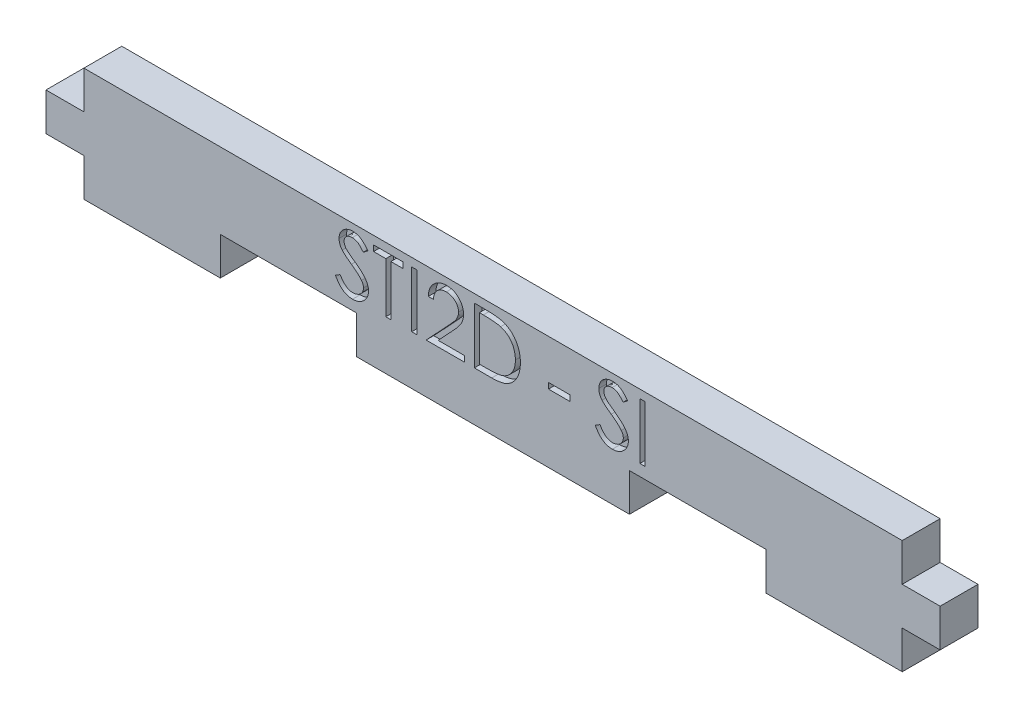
from build123d import *

# Parameters (mm, degrees)
ESQUISSE1_W             = 118
ESQUISSE1_H             = 15
BOSS_EXTRU_1_DEPTH      = 5
ESQUISSE2_W             = 5
ESQUISSE2_H             = 5
ESQUISSE2_W_2           = 18
ENL_V_MAT_EXTRU_1_DEPTH = 60.684587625
ESQUISSE5_W             = 0.664850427
ESQUISSE5_H             = 7.408333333
ESQUISSE5_W_2           = 2.849358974
ESQUISSE5_H_2           = 0.75982906
ENL_V_MAT_EXTRU_4_DEPTH = 1


with BuildPart() as part:
    # Esquisse1 → Boss.-Extru.1 (new body)
    with BuildSketch(Plane.XY):
        Rectangle(ESQUISSE1_W, ESQUISSE1_H)
    extrude(amount=BOSS_EXTRU_1_DEPTH)

    # Esquisse2 → Enl_v. mat.-Extru.1 (cut, symmetric)
    with BuildSketch(Plane.XY.offset(5)):
        with Locations((-56.5, 5)):
            Rectangle(ESQUISSE2_W, ESQUISSE2_H)
        with Locations((-56.5, -5)):
            Rectangle(ESQUISSE2_W, ESQUISSE2_H)
        with Locations((-27, -5)):
            Rectangle(ESQUISSE2_W_2, ESQUISSE2_H)
    enl_v_mat_extru_1 = extrude(amount=ENL_V_MAT_EXTRU_1_DEPTH, both=True, mode=Mode.SUBTRACT)

    # Sym_trie1: Enl_v. mat.-Extru.1 across plane
    add(enl_v_mat_extru_1.mirror(Plane.ZY), mode=Mode.SUBTRACT)

    # Esquisse5 → Enl_v. mat.-Extru.4 (cut)
    # profile 1 of 8: a face of its own
    with BuildSketch(Plane.XY.offset(5)):
        with BuildLine():
            Line((-20.800320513, 0.429131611), (-20.174055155, 0.804594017))
            add(Edge.make_bspline(
                [(-20.174055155, 0.804594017), (-20.115808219, 0.707091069), (-20.004209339, 0.520279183), (-19.818045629, 0.267849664), (-19.625147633, 0.053299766), (-19.424086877, -0.122122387), (-19.21609062, -0.260232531), (-18.99980104, -0.358027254), (-18.775947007, -0.419021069), (-18.623602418, -0.426429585), (-18.547546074, -0.430128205)],
                knots=[0, 0, 0, 0, 1.272034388, 2.437168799, 3.508375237, 4.49857839, 5.41946034, 6.295179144, 7.148887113, 8, 8, 8, 8], degree=3))
            add(Edge.make_bspline(
                [(-18.547546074, -0.430128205), (-18.482592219, -0.428319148), (-18.353821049, -0.424732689), (-18.164247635, -0.390271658), (-17.980136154, -0.337329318), (-17.805281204, -0.261508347), (-17.642095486, -0.169775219), (-17.498994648, -0.05897581), (-17.375283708, 0.065073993), (-17.274087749, 0.203467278), (-17.196448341, 0.352305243), (-17.13677513, 0.505077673), (-17.103659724, 0.664184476), (-17.098671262, 0.771309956), (-17.096153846, 0.825370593)],
                knots=[0, 0, 0, 0, 1.095163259, 2.171163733, 3.241058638, 4.321873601, 5.38011039, 6.391990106, 7.366004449, 8.327778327, 9.272591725, 10.192022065, 11.087607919, 12, 12, 12, 12], degree=3))
            add(Edge.make_bspline(
                [(-17.096153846, 0.825370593), (-17.09927447, 0.887052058), (-17.105618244, 1.012441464), (-17.159236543, 1.197437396), (-17.243584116, 1.380513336), (-17.321398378, 1.493757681), (-17.361797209, 1.552550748)],
                knots=[0, 0, 0, 0, 0.938893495, 1.908633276, 2.914225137, 4, 4, 4, 4], degree=3))
            add(Edge.make_bspline(
                [(-17.361797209, 1.552550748), (-17.394966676, 1.594983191), (-17.464601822, 1.684064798), (-17.584315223, 1.81666388), (-17.724790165, 1.953439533), (-17.881219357, 2.099614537), (-18.059301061, 2.248390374), (-18.253457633, 2.406861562), (-18.468646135, 2.569001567), (-18.619563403, 2.677740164), (-18.697434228, 2.733847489)],
                knots=[0, 0, 0, 0, 0.722233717, 1.516239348, 2.393582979, 3.351407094, 4.387010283, 5.505090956, 6.712668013, 8, 8, 8, 8], degree=3))
            add(Edge.make_bspline(
                [(-18.697434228, 2.733847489), (-18.775378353, 2.789364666), (-18.924401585, 2.895509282), (-19.132805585, 3.053040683), (-19.319166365, 3.197066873), (-19.482655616, 3.328943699), (-19.62320143, 3.448689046), (-19.741911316, 3.555153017), (-19.835761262, 3.651214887), (-19.887948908, 3.713532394), (-19.911379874, 3.741511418)],
                knots=[0, 0, 0, 0, 1.452282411, 2.77665338, 3.964542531, 5.026858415, 5.96415736, 6.766646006, 7.446254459, 8, 8, 8, 8], degree=3))
            add(Edge.make_bspline(
                [(-19.911379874, 3.741511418), (-19.944130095, 3.785116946), (-20.0085378, 3.870873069), (-20.093555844, 4.004910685), (-20.165817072, 4.14211993), (-20.222464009, 4.28286951), (-20.270165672, 4.425183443), (-20.302249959, 4.57091858), (-20.322340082, 4.719420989), (-20.324397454, 4.819356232), (-20.32542735, 4.869382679)],
                knots=[0, 0, 0, 0, 1.068054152, 2.10047183, 3.106115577, 4.101338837, 5.06977816, 6.043150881, 7.020423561, 8, 8, 8, 8], degree=3))
            add(Edge.make_bspline(
                [(-20.32542735, 4.869382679), (-20.322664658, 4.947762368), (-20.317198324, 5.102846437), (-20.270969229, 5.329395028), (-20.198001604, 5.545689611), (-20.095777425, 5.749588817), (-19.963999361, 5.935783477), (-19.811502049, 6.106415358), (-19.629867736, 6.249858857), (-19.430578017, 6.375191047), (-19.212442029, 6.473289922), (-18.983861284, 6.547290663), (-18.744472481, 6.589220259), (-18.58232918, 6.595237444), (-18.500056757, 6.598290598)],
                knots=[0, 0, 0, 0, 1.005424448, 1.989358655, 2.955360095, 3.929531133, 4.905563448, 5.876582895, 6.856512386, 7.866279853, 8.892233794, 9.918561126, 10.94386622, 12, 12, 12, 12], degree=3))
            add(Edge.make_bspline(
                [(-18.500056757, 6.598290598), (-18.412756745, 6.595279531), (-18.239144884, 6.589291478), (-17.983770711, 6.537226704), (-17.737897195, 6.451076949), (-17.540108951, 6.353310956), (-17.385311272, 6.255666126), (-17.267258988, 6.166724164), (-17.147630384, 6.064330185), (-17.025460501, 5.948211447), (-16.902819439, 5.817302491), (-16.777886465, 5.672499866), (-16.650369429, 5.514688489), (-16.568336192, 5.402029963), (-16.526282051, 5.344275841)],
                knots=[0, 0, 0, 0, 1.286793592, 2.559021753, 3.825965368, 5.121522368, 5.803751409, 6.523245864, 7.299691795, 8.125521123, 9.008227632, 9.944561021, 10.946284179, 12, 12, 12, 12], degree=3))
            Line((-16.526282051, 5.344275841), (-17.12731871, 4.888675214))
            add(Edge.make_bspline(
                [(-17.12731871, 4.888675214), (-17.163610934, 4.935429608), (-17.233501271, 5.025467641), (-17.339608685, 5.151560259), (-17.439618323, 5.266741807), (-17.538150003, 5.366786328), (-17.629999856, 5.457172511), (-17.719147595, 5.534557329), (-17.804310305, 5.599699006), (-17.9116611, 5.669217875), (-18.04653027, 5.738129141), (-18.215830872, 5.796441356), (-18.392755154, 5.831482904), (-18.513256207, 5.836116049), (-18.574258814, 5.838461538)],
                knots=[0, 0, 0, 0, 1.181633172, 2.275549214, 3.290209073, 4.226197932, 5.078386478, 5.862611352, 6.581680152, 7.217281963, 8.414376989, 9.595101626, 10.782541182, 12, 12, 12, 12], degree=3))
            add(Edge.make_bspline(
                [(-18.574258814, 5.838461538), (-18.65079012, 5.835896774), (-18.798373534, 5.830950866), (-19.007902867, 5.776933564), (-19.196485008, 5.69188196), (-19.358521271, 5.572681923), (-19.493431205, 5.431455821), (-19.591021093, 5.268940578), (-19.649758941, 5.089484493), (-19.656926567, 4.96430132), (-19.660576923, 4.900547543)],
                knots=[0, 0, 0, 0, 1.14458467, 2.207223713, 3.21896685, 4.227309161, 5.202851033, 6.127160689, 7.046193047, 8, 8, 8, 8], degree=3))
            add(Edge.make_bspline(
                [(-19.660576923, 4.900547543), (-19.659744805, 4.860856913), (-19.658079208, 4.781410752), (-19.63484922, 4.664038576), (-19.60500564, 4.546962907), (-19.557713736, 4.430710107), (-19.49242451, 4.313247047), (-19.406688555, 4.192551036), (-19.298710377, 4.067558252), (-19.215997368, 3.986262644), (-19.17232739, 3.943341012)],
                knots=[0, 0, 0, 0, 0.858281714, 1.717966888, 2.583508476, 3.4729293, 4.427298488, 5.488583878, 6.674047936, 8, 8, 8, 8], degree=3))
            add(Edge.make_bspline(
                [(-19.17232739, 3.943341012), (-19.156110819, 3.928869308), (-19.117583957, 3.89448785), (-19.047149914, 3.838200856), (-18.954137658, 3.768768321), (-18.840975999, 3.682858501), (-18.705578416, 3.58320274), (-18.547930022, 3.471075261), (-18.369788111, 3.342836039), (-18.243376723, 3.253179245), (-18.176535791, 3.205772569)],
                knots=[0, 0, 0, 0, 0.420754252, 0.999615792, 1.744751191, 2.668019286, 3.750313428, 4.999500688, 6.413464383, 8, 8, 8, 8], degree=3))
            add(Edge.make_bspline(
                [(-18.176535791, 3.205772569), (-18.096132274, 3.147265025), (-17.940442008, 3.033973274), (-17.718916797, 2.863760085), (-17.518058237, 2.697288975), (-17.337161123, 2.53562304), (-17.174438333, 2.379988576), (-17.031695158, 2.228513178), (-16.907477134, 2.082282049), (-16.773747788, 1.894803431), (-16.637100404, 1.664550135), (-16.519749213, 1.382444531), (-16.445754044, 1.099242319), (-16.43607767, 0.908897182), (-16.431303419, 0.814982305)],
                knots=[0, 0, 0, 0, 1.163667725, 2.253281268, 3.268753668, 4.215851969, 5.092017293, 5.902905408, 6.650798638, 7.335211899, 8.59617414, 9.77448103, 10.901945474, 12, 12, 12, 12], degree=3))
            add(Edge.make_bspline(
                [(-16.431303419, 0.814982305), (-16.432694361, 0.748564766), (-16.435449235, 0.61701947), (-16.467116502, 0.423862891), (-16.513513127, 0.236260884), (-16.583441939, 0.056532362), (-16.668792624, -0.118610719), (-16.777094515, -0.284574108), (-16.902629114, -0.445030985), (-17.046633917, -0.595702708), (-17.204211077, -0.734018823), (-17.37075823, -0.85705867), (-17.546547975, -0.959649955), (-17.730626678, -1.043365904), (-17.923036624, -1.108841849), (-18.1237131, -1.156282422), (-18.332986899, -1.185398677), (-18.475227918, -1.188420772), (-18.547546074, -1.189957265)],
                knots=[0, 0, 0, 0, 0.983748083, 1.948392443, 2.894712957, 3.844097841, 4.80183111, 5.778335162, 6.776009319, 7.81870978, 8.863265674, 9.881300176, 10.883814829, 11.87499822, 12.874611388, 13.892143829, 14.928324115, 16, 16, 16, 16], degree=3))
            add(Edge.make_bspline(
                [(-18.547546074, -1.189957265), (-18.603500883, -1.188875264), (-18.714705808, -1.186724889), (-18.879190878, -1.167714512), (-19.040353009, -1.140817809), (-19.196169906, -1.098116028), (-19.348649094, -1.046306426), (-19.497127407, -0.982513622), (-19.641676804, -0.906065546), (-19.783107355, -0.818657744), (-19.921059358, -0.716935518), (-20.054238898, -0.598458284), (-20.187015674, -0.466493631), (-20.315470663, -0.317457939), (-20.442202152, -0.153758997), (-20.564711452, 0.026134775), (-20.685534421, 0.221243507), (-20.761343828, 0.358541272), (-20.800320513, 0.429131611)],
                knots=[0, 0, 0, 0, 0.915332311, 1.819136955, 2.706846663, 3.586547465, 4.459518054, 5.340707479, 6.227863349, 7.133153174, 8.059268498, 9.028702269, 10.047606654, 11.120612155, 12.245963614, 13.433783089, 14.680604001, 16, 16, 16, 16], degree=3))
        make_face()
    # profile 2 of 8: a face of its own
    with BuildSketch(Plane.XY.offset(5)):
        Polygon((-15.766452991, 5.648504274), (-15.766452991, 6.408333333), (-11.87232906, 6.408333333), (-11.87232906, 5.648504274), (-13.486965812, 5.648504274), (-13.486965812, -1), (-14.151816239, -1), (-14.151816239, 5.648504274), align=None)
    # profile 3 of 8: a face of its own
    with BuildSketch(Plane.XY.offset(5)):
        with Locations((-10.400160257, 2.704166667)):
            Rectangle(ESQUISSE5_W, ESQUISSE5_H)
    # profile 4 of 8: a face of its own
    with BuildSketch(Plane.XY.offset(5)):
        with BuildLine():
            Line((-7.883226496, 4.128846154), (-8.548076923, 4.128846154))
            add(Edge.make_bspline(
                [(-8.548076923, 4.128846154), (-8.543743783, 4.217049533), (-8.53523361, 4.390278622), (-8.495380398, 4.642847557), (-8.438355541, 4.884263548), (-8.35772863, 5.112588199), (-8.257597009, 5.329840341), (-8.137518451, 5.535157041), (-7.995291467, 5.727755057), (-7.833987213, 5.905848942), (-7.658793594, 6.0692293), (-7.469762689, 6.210316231), (-7.271124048, 6.329521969), (-7.06348032, 6.429177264), (-6.844488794, 6.503979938), (-6.616136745, 6.559482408), (-6.377420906, 6.592875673), (-6.214776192, 6.596465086), (-6.132057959, 6.598290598)],
                knots=[0, 0, 0, 0, 1.10065271, 2.161652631, 3.183658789, 4.190468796, 5.17591951, 6.163126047, 7.15150782, 8.156236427, 9.156009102, 10.134482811, 11.092018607, 12.041330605, 13.001268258, 13.972401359, 14.968799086, 16, 16, 16, 16], degree=3))
            add(Edge.make_bspline(
                [(-6.132057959, 6.598290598), (-6.050824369, 6.596388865), (-5.891203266, 6.592652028), (-5.658238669, 6.560561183), (-5.436460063, 6.510299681), (-5.226300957, 6.43978205), (-5.02943812, 6.344988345), (-4.844392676, 6.231116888), (-4.668961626, 6.099418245), (-4.511043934, 5.94436434), (-4.366035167, 5.77883596), (-4.240935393, 5.602119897), (-4.133804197, 5.419601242), (-4.044506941, 5.229888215), (-3.978771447, 5.031194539), (-3.92886424, 4.826412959), (-3.900654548, 4.613423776), (-3.896325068, 4.4692649), (-3.894123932, 4.395973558)],
                knots=[0, 0, 0, 0, 1.111607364, 2.184268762, 3.212621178, 4.221274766, 5.211760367, 6.196651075, 7.1921475, 8.207485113, 9.220403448, 10.201281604, 11.166441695, 12.114753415, 13.065576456, 14.026450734, 14.996634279, 16, 16, 16, 16], degree=3))
            add(Edge.make_bspline(
                [(-3.894123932, 4.395973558), (-3.897708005, 4.292790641), (-3.904813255, 4.088235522), (-3.965592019, 3.787637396), (-4.060517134, 3.496397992), (-4.17481154, 3.262004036), (-4.290111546, 3.073126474), (-4.394013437, 2.917617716), (-4.515647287, 2.750177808), (-4.656783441, 2.571367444), (-4.814502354, 2.379786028), (-4.9902326, 2.175549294), (-5.185227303, 1.960767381), (-5.322087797, 1.814070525), (-5.393005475, 1.738055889)],
                knots=[0, 0, 0, 0, 1.184426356, 2.348067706, 3.509069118, 4.696110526, 5.333549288, 6.050745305, 6.844228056, 7.710549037, 8.667450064, 9.695053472, 10.805634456, 12, 12, 12, 12], degree=3))
            Line((-5.393005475, 1.738055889), (-7.24657285, -0.24017094))
            Line((-7.24657285, -0.24017094), (-3.799145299, -0.24017094))
            Line((-3.799145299, -0.24017094), (-3.799145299, -1))
            Line((-3.799145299, -1), (-8.833012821, -1))
            Line((-8.833012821, -1), (-5.959909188, 2.06602898))
            add(Edge.make_bspline(
                [(-5.959909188, 2.06602898), (-5.889957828, 2.139050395), (-5.75559558, 2.27930959), (-5.565555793, 2.484082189), (-5.394869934, 2.67405205), (-5.242433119, 2.848860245), (-5.1115522, 3.01106373), (-4.995405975, 3.155409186), (-4.902345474, 3.288239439), (-4.801347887, 3.442207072), (-4.703528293, 3.630193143), (-4.619470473, 3.859922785), (-4.56821571, 4.096412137), (-4.562067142, 4.256224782), (-4.558974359, 4.336611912)],
                knots=[0, 0, 0, 0, 1.329631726, 2.553950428, 3.673215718, 4.687767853, 5.603093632, 6.413772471, 7.123043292, 7.734684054, 8.834405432, 9.900288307, 10.943827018, 12, 12, 12, 12], degree=3))
            add(Edge.make_bspline(
                [(-4.558974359, 4.336611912), (-4.560320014, 4.387160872), (-4.56297204, 4.486783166), (-4.5863775, 4.632845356), (-4.621748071, 4.773740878), (-4.672432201, 4.909903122), (-4.739333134, 5.039963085), (-4.820768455, 5.164079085), (-4.914727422, 5.284070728), (-5.023420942, 5.396578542), (-5.142825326, 5.499620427), (-5.268966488, 5.590899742), (-5.402422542, 5.667182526), (-5.5426308, 5.729716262), (-5.689200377, 5.778770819), (-5.842414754, 5.812761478), (-6.001850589, 5.834102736), (-6.110718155, 5.836990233), (-6.166190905, 5.838461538)],
                knots=[0, 0, 0, 0, 0.991446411, 1.95395049, 2.89581595, 3.838931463, 4.798493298, 5.75982156, 6.748411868, 7.785213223, 8.824556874, 9.840280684, 10.836137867, 11.835679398, 12.848801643, 13.863922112, 14.911575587, 16, 16, 16, 16], degree=3))
            add(Edge.make_bspline(
                [(-6.166190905, 5.838461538), (-6.224125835, 5.836948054), (-6.33790047, 5.833975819), (-6.504945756, 5.813184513), (-6.664300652, 5.777315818), (-6.816366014, 5.728258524), (-6.961399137, 5.665904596), (-7.098694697, 5.588240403), (-7.227944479, 5.495565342), (-7.349391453, 5.390492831), (-7.461286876, 5.273509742), (-7.55959943, 5.143101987), (-7.64550226, 5.001650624), (-7.720451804, 4.849537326), (-7.781318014, 4.685381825), (-7.82782785, 4.509766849), (-7.864630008, 4.323454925), (-7.87692471, 4.194793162), (-7.883226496, 4.128846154)],
                knots=[0, 0, 0, 0, 1.031018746, 2.02475058, 2.990194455, 3.934040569, 4.864654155, 5.795059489, 6.735614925, 7.690564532, 8.649604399, 9.611025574, 10.590972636, 11.591080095, 12.624614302, 13.701020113, 14.821632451, 16, 16, 16, 16], degree=3))
        make_face()
    # profile 5 of 8: a face of its own
    with BuildSketch(Plane.XY.offset(5)):
        with BuildLine():
            Line((-2.469444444, -1), (-2.469444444, 6.408333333))
            Line((-2.469444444, 6.408333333), (-0.973530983, 6.408333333))
            add(Edge.make_bspline(
                [(-0.973530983, 6.408333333), (-0.843421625, 6.40739656), (-0.592051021, 6.405586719), (-0.228804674, 6.394111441), (0.107287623, 6.373811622), (0.415120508, 6.344242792), (0.695539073, 6.307935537), (0.947758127, 6.262426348), (1.17308183, 6.208688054), (1.311658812, 6.162871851), (1.377190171, 6.141205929)],
                knots=[0, 0, 0, 0, 1.314313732, 2.53924729, 3.670748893, 4.714932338, 5.66265055, 6.526160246, 7.303039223, 8, 8, 8, 8], degree=3))
            add(Edge.make_bspline(
                [(1.377190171, 6.141205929), (1.462904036, 6.108544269), (1.632388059, 6.043961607), (1.873703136, 5.922134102), (2.100875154, 5.784099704), (2.315122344, 5.629676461), (2.51155076, 5.454491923), (2.697834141, 5.265987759), (2.866351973, 5.057309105), (3.020674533, 4.832783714), (3.159815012, 4.595056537), (3.280759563, 4.344580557), (3.381203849, 4.0826278), (3.464586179, 3.809926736), (3.53030118, 3.525877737), (3.575136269, 3.230150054), (3.604708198, 2.923912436), (3.607680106, 2.716109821), (3.609188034, 2.610672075)],
                knots=[0, 0, 0, 0, 0.984719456, 1.947108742, 2.898477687, 3.838006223, 4.779231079, 5.722358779, 6.681677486, 7.655904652, 8.64651281, 9.637519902, 10.640069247, 11.656948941, 12.698408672, 13.768548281, 14.867775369, 16, 16, 16, 16], degree=3))
            add(Edge.make_bspline(
                [(3.609188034, 2.610672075), (3.60785672, 2.519102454), (3.605233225, 2.338654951), (3.581676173, 2.072715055), (3.547436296, 1.814664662), (3.494426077, 1.565732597), (3.430074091, 1.323737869), (3.34759997, 1.091259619), (3.253121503, 0.866165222), (3.14294926, 0.651498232), (3.021999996, 0.44812176), (2.892202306, 0.256403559), (2.753694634, 0.079079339), (2.605156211, -0.084387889), (2.448506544, -0.233751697), (2.282720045, -0.370259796), (2.107368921, -0.49124117), (1.923238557, -0.601449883), (1.724957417, -0.697589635), (1.508769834, -0.778933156), (1.27375384, -0.846341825), (1.020486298, -0.902583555), (0.748529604, -0.947197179), (0.457617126, -0.977098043), (0.148195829, -0.997318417), (-0.064273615, -0.999088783), (-0.173632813, -1)],
                knots=[0, 0, 0, 0, 1.105936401, 2.179363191, 3.223086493, 4.248585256, 5.251745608, 6.245858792, 7.225916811, 8.198733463, 9.158002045, 10.082870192, 10.993790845, 11.873723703, 12.748670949, 13.606408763, 14.465103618, 15.319838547, 16.196477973, 17.123216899, 18.106603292, 19.147568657, 20.255746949, 21.433717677, 22.679120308, 24, 24, 24, 24], degree=3))
            Line((-0.173632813, -1), (-2.469444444, -1))
        make_face()
        with BuildLine():
            Line((-1.804594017, -0.24017094), (-0.954238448, -0.24017094))
            add(Edge.make_bspline(
                [(-0.954238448, -0.24017094), (-0.83204673, -0.239645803), (-0.597027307, -0.238635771), (-0.259084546, -0.229772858), (0.04969351, -0.215290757), (0.329350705, -0.195023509), (0.57972914, -0.168208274), (0.801352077, -0.138310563), (0.99349304, -0.101062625), (1.109760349, -0.067299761), (1.163488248, -0.051697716)],
                knots=[0, 0, 0, 0, 1.375205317, 2.645023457, 3.804390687, 4.853969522, 5.800190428, 6.637939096, 7.370582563, 8, 8, 8, 8], degree=3))
            add(Edge.make_bspline(
                [(1.163488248, -0.051697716), (1.231112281, -0.027881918), (1.364745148, 0.019180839), (1.557110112, 0.105027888), (1.736512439, 0.206716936), (1.906078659, 0.319751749), (2.063403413, 0.44811912), (2.210351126, 0.589027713), (2.346625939, 0.743194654), (2.47081989, 0.910428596), (2.581962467, 1.089688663), (2.678209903, 1.279212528), (2.762562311, 1.476923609), (2.828768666, 1.685857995), (2.880659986, 1.904147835), (2.917415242, 2.131808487), (2.940306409, 2.368797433), (2.942976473, 2.529986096), (2.944337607, 2.612156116)],
                knots=[0, 0, 0, 0, 0.998632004, 1.973411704, 2.929992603, 3.868527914, 4.809262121, 5.754881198, 6.702106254, 7.672490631, 8.653608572, 9.636854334, 10.631411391, 11.644891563, 12.686317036, 13.754757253, 14.855430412, 16, 16, 16, 16], degree=3))
            add(Edge.make_bspline(
                [(2.944337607, 2.612156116), (2.943251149, 2.69879865), (2.941116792, 2.869008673), (2.914289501, 3.118755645), (2.875085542, 3.358956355), (2.818393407, 3.589626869), (2.746149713, 3.811217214), (2.655991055, 4.022501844), (2.552980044, 4.22571215), (2.430417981, 4.416157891), (2.296188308, 4.596271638), (2.147221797, 4.76127621), (1.985885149, 4.911547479), (1.813938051, 5.04942569), (1.626534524, 5.169363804), (1.428089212, 5.276650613), (1.215690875, 5.367700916), (1.067920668, 5.416127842), (0.992823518, 5.440738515)],
                knots=[0, 0, 0, 0, 1.122418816, 2.205001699, 3.251619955, 4.274784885, 5.280384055, 6.268708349, 7.249350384, 8.229342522, 9.199999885, 10.157847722, 11.105861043, 12.055065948, 13.010012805, 13.98527497, 14.976112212, 16, 16, 16, 16], degree=3))
            add(Edge.make_bspline(
                [(0.992823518, 5.440738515), (0.930696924, 5.457918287), (0.798598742, 5.494447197), (0.583038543, 5.534294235), (0.340436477, 5.569440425), (0.069715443, 5.599196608), (-0.228815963, 5.620548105), (-0.555387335, 5.636574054), (-0.910139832, 5.647383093), (-1.156059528, 5.64812119), (-1.28369558, 5.648504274)],
                knots=[0, 0, 0, 0, 0.674548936, 1.434276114, 2.292660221, 3.240891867, 4.284742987, 5.42552168, 6.663806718, 8, 8, 8, 8], degree=3))
            Line((-1.28369558, 5.648504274), (-1.804594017, 5.648504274))
            Line((-1.804594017, 5.648504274), (-1.804594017, -0.24017094))
        make_face(mode=Mode.SUBTRACT)
    # profile 6 of 8: a face of its own
    with BuildSketch(Plane.XY.offset(5)):
        with Locations((8.738034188, 1.849358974)):
            Rectangle(ESQUISSE5_W_2, ESQUISSE5_H_2)
    # profile 7 of 8: a face of its own
    with BuildSketch(Plane.XY.offset(5)):
        with BuildLine():
            Line((13.486965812, 0.429131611), (14.11323117, 0.804594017))
            add(Edge.make_bspline(
                [(14.11323117, 0.804594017), (14.171478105, 0.707091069), (14.283076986, 0.520279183), (14.469240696, 0.267849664), (14.662138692, 0.053299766), (14.863199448, -0.122122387), (15.071195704, -0.260232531), (15.287485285, -0.358027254), (15.511339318, -0.419021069), (15.663683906, -0.426429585), (15.739740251, -0.430128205)],
                knots=[0, 0, 0, 0, 1.272034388, 2.437168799, 3.508375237, 4.49857839, 5.41946034, 6.295179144, 7.148887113, 8, 8, 8, 8], degree=3))
            add(Edge.make_bspline(
                [(15.739740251, -0.430128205), (15.804694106, -0.428319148), (15.933465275, -0.424732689), (16.12303869, -0.390271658), (16.307150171, -0.337329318), (16.482005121, -0.261508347), (16.645190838, -0.169775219), (16.788291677, -0.05897581), (16.912002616, 0.065073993), (17.013198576, 0.203467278), (17.090837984, 0.352305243), (17.150511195, 0.505077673), (17.183626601, 0.664184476), (17.188615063, 0.771309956), (17.191132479, 0.825370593)],
                knots=[0, 0, 0, 0, 1.095163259, 2.171163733, 3.241058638, 4.321873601, 5.38011039, 6.391990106, 7.366004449, 8.327778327, 9.272591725, 10.192022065, 11.087607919, 12, 12, 12, 12], degree=3))
            add(Edge.make_bspline(
                [(17.191132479, 0.825370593), (17.188011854, 0.887052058), (17.181668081, 1.012441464), (17.128049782, 1.197437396), (17.043702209, 1.380513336), (16.965887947, 1.493757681), (16.925489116, 1.552550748)],
                knots=[0, 0, 0, 0, 0.938893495, 1.908633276, 2.914225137, 4, 4, 4, 4], degree=3))
            add(Edge.make_bspline(
                [(16.925489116, 1.552550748), (16.892319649, 1.594983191), (16.822684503, 1.684064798), (16.702971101, 1.81666388), (16.562496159, 1.953439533), (16.406066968, 2.099614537), (16.227985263, 2.248390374), (16.033828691, 2.406861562), (15.81864019, 2.569001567), (15.667722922, 2.677740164), (15.589852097, 2.733847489)],
                knots=[0, 0, 0, 0, 0.722233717, 1.516239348, 2.393582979, 3.351407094, 4.387010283, 5.505090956, 6.712668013, 8, 8, 8, 8], degree=3))
            add(Edge.make_bspline(
                [(15.589852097, 2.733847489), (15.511907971, 2.789364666), (15.362884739, 2.895509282), (15.15448074, 3.053040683), (14.96811996, 3.197066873), (14.804630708, 3.328943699), (14.664084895, 3.448689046), (14.545375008, 3.555153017), (14.451525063, 3.651214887), (14.399337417, 3.713532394), (14.37590645, 3.741511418)],
                knots=[0, 0, 0, 0, 1.452282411, 2.77665338, 3.964542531, 5.026858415, 5.96415736, 6.766646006, 7.446254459, 8, 8, 8, 8], degree=3))
            add(Edge.make_bspline(
                [(14.37590645, 3.741511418), (14.34315623, 3.785116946), (14.278748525, 3.870873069), (14.19373048, 4.004910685), (14.121469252, 4.14211993), (14.064822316, 4.28286951), (14.017120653, 4.425183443), (13.985036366, 4.57091858), (13.964946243, 4.719420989), (13.962888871, 4.819356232), (13.961858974, 4.869382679)],
                knots=[0, 0, 0, 0, 1.068054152, 2.10047183, 3.106115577, 4.101338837, 5.06977816, 6.043150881, 7.020423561, 8, 8, 8, 8], degree=3))
            add(Edge.make_bspline(
                [(13.961858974, 4.869382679), (13.964621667, 4.947762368), (13.970088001, 5.102846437), (14.016317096, 5.329395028), (14.089284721, 5.545689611), (14.1915089, 5.749588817), (14.323286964, 5.935783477), (14.475784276, 6.106415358), (14.657418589, 6.249858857), (14.856708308, 6.375191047), (15.074844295, 6.473289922), (15.303425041, 6.547290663), (15.542813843, 6.589220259), (15.704957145, 6.595237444), (15.787229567, 6.598290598)],
                knots=[0, 0, 0, 0, 1.005424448, 1.989358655, 2.955360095, 3.929531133, 4.905563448, 5.876582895, 6.856512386, 7.866279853, 8.892233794, 9.918561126, 10.94386622, 12, 12, 12, 12], degree=3))
            add(Edge.make_bspline(
                [(15.787229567, 6.598290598), (15.87452958, 6.595279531), (16.048141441, 6.589291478), (16.303515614, 6.537226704), (16.54938913, 6.451076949), (16.747177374, 6.353310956), (16.901975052, 6.255666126), (17.020027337, 6.166724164), (17.139655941, 6.064330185), (17.261825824, 5.948211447), (17.384466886, 5.817302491), (17.50939986, 5.672499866), (17.636916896, 5.514688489), (17.718950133, 5.402029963), (17.761004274, 5.344275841)],
                knots=[0, 0, 0, 0, 1.286793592, 2.559021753, 3.825965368, 5.121522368, 5.803751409, 6.523245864, 7.299691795, 8.125521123, 9.008227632, 9.944561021, 10.946284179, 12, 12, 12, 12], degree=3))
            Line((17.761004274, 5.344275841), (17.159967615, 4.888675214))
            add(Edge.make_bspline(
                [(17.159967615, 4.888675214), (17.123675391, 4.935429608), (17.053785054, 5.025467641), (16.94767764, 5.151560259), (16.847668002, 5.266741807), (16.749136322, 5.366786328), (16.657286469, 5.457172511), (16.568138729, 5.534557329), (16.482976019, 5.599699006), (16.375625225, 5.669217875), (16.240756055, 5.738129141), (16.071455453, 5.796441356), (15.894531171, 5.831482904), (15.774030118, 5.836116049), (15.713027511, 5.838461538)],
                knots=[0, 0, 0, 0, 1.181633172, 2.275549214, 3.290209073, 4.226197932, 5.078386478, 5.862611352, 6.581680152, 7.217281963, 8.414376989, 9.595101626, 10.782541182, 12, 12, 12, 12], degree=3))
            add(Edge.make_bspline(
                [(15.713027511, 5.838461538), (15.636496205, 5.835896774), (15.488912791, 5.830950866), (15.279383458, 5.776933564), (15.090801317, 5.69188196), (14.928765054, 5.572681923), (14.793855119, 5.431455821), (14.696265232, 5.268940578), (14.637527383, 5.089484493), (14.630359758, 4.96430132), (14.626709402, 4.900547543)],
                knots=[0, 0, 0, 0, 1.14458467, 2.207223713, 3.21896685, 4.227309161, 5.202851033, 6.127160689, 7.046193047, 8, 8, 8, 8], degree=3))
            add(Edge.make_bspline(
                [(14.626709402, 4.900547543), (14.62754152, 4.860856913), (14.629207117, 4.781410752), (14.652437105, 4.664038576), (14.682280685, 4.546962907), (14.729572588, 4.430710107), (14.794861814, 4.313247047), (14.88059777, 4.192551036), (14.988575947, 4.067558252), (15.071288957, 3.986262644), (15.114958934, 3.943341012)],
                knots=[0, 0, 0, 0, 0.858281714, 1.717966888, 2.583508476, 3.4729293, 4.427298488, 5.488583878, 6.674047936, 8, 8, 8, 8], degree=3))
            add(Edge.make_bspline(
                [(15.114958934, 3.943341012), (15.131175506, 3.928869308), (15.169702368, 3.89448785), (15.240136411, 3.838200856), (15.333148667, 3.768768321), (15.446310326, 3.682858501), (15.581707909, 3.58320274), (15.739356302, 3.471075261), (15.917498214, 3.342836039), (16.043909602, 3.253179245), (16.110750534, 3.205772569)],
                knots=[0, 0, 0, 0, 0.420754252, 0.999615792, 1.744751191, 2.668019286, 3.750313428, 4.999500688, 6.413464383, 8, 8, 8, 8], degree=3))
            add(Edge.make_bspline(
                [(16.110750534, 3.205772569), (16.191154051, 3.147265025), (16.346844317, 3.033973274), (16.568369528, 2.863760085), (16.769228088, 2.697288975), (16.950125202, 2.53562304), (17.112847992, 2.379988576), (17.255591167, 2.228513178), (17.379809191, 2.082282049), (17.513538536, 1.894803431), (17.650185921, 1.664550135), (17.767537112, 1.382444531), (17.84153228, 1.099242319), (17.851208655, 0.908897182), (17.855982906, 0.814982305)],
                knots=[0, 0, 0, 0, 1.163667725, 2.253281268, 3.268753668, 4.215851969, 5.092017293, 5.902905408, 6.650798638, 7.335211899, 8.59617414, 9.77448103, 10.901945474, 12, 12, 12, 12], degree=3))
            add(Edge.make_bspline(
                [(17.855982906, 0.814982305), (17.854591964, 0.748564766), (17.85183709, 0.61701947), (17.820169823, 0.423862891), (17.773773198, 0.236260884), (17.703844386, 0.056532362), (17.618493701, -0.118610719), (17.51019181, -0.284574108), (17.38465721, -0.445030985), (17.240652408, -0.595702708), (17.083075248, -0.734018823), (16.916528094, -0.85705867), (16.74073835, -0.959649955), (16.556659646, -1.043365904), (16.3642497, -1.108841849), (16.163573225, -1.156282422), (15.954299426, -1.185398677), (15.812058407, -1.188420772), (15.739740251, -1.189957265)],
                knots=[0, 0, 0, 0, 0.983748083, 1.948392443, 2.894712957, 3.844097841, 4.80183111, 5.778335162, 6.776009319, 7.81870978, 8.863265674, 9.881300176, 10.883814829, 11.87499822, 12.874611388, 13.892143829, 14.928324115, 16, 16, 16, 16], degree=3))
            add(Edge.make_bspline(
                [(15.739740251, -1.189957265), (15.683785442, -1.188875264), (15.572580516, -1.186724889), (15.408095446, -1.167714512), (15.246933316, -1.140817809), (15.091116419, -1.098116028), (14.938637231, -1.046306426), (14.790158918, -0.982513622), (14.645609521, -0.906065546), (14.50417897, -0.818657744), (14.366226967, -0.716935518), (14.233047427, -0.598458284), (14.100270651, -0.466493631), (13.971815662, -0.317457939), (13.845084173, -0.153758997), (13.722574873, 0.026134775), (13.601751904, 0.221243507), (13.525942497, 0.358541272), (13.486965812, 0.429131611)],
                knots=[0, 0, 0, 0, 0.915332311, 1.819136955, 2.706846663, 3.586547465, 4.459518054, 5.340707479, 6.227863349, 7.133153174, 8.059268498, 9.028702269, 10.047606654, 11.120612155, 12.245963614, 13.433783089, 14.680604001, 16, 16, 16, 16], degree=3))
        make_face()
    # profile 8 of 8: a face of its own
    with BuildSketch(Plane.XY.offset(5)):
        with Locations((19.708066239, 2.704166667)):
            Rectangle(ESQUISSE5_W, ESQUISSE5_H)
    extrude(amount=-ENL_V_MAT_EXTRU_4_DEPTH, mode=Mode.SUBTRACT)


solid = part.part
